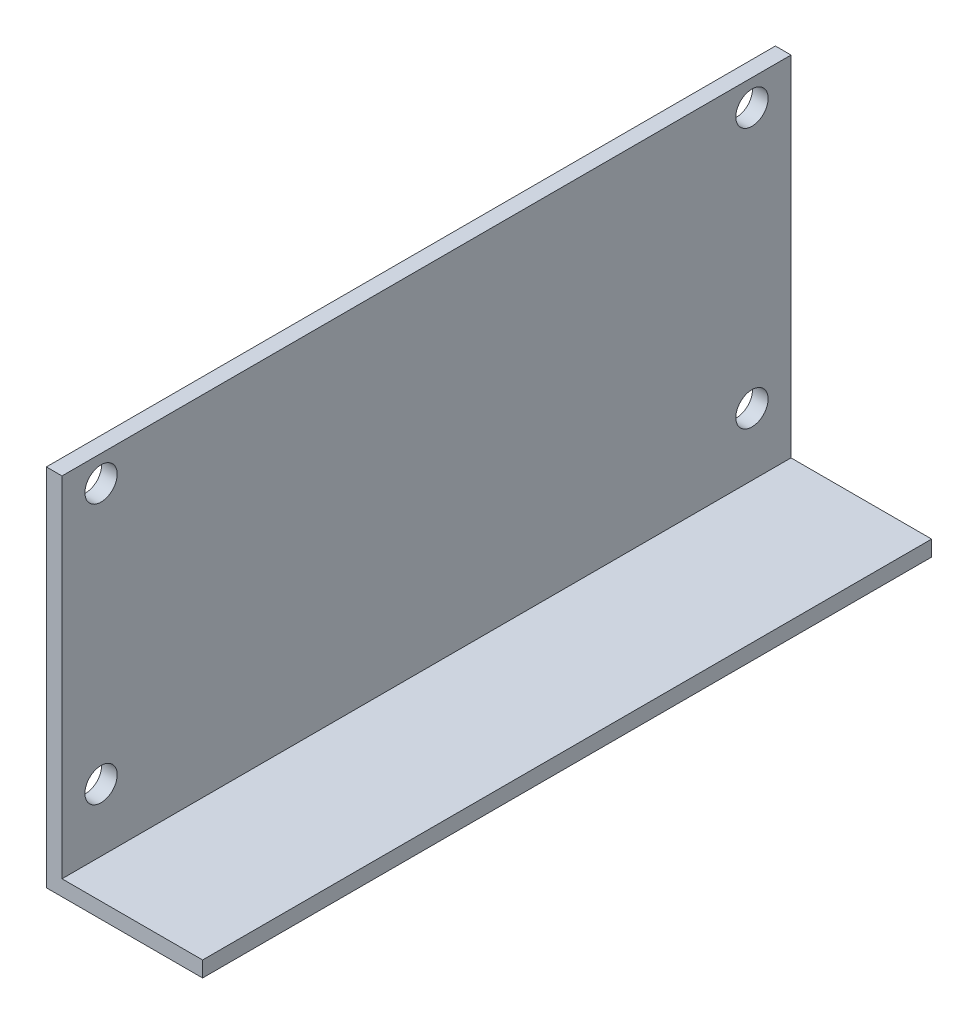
ISO-10303-21;
HEADER;
FILE_DESCRIPTION(('STEP AP214'),'2;1');
FILE_NAME('part.step','',(''),(''),'','','');
FILE_SCHEMA(('AUTOMOTIVE_DESIGN { 1 0 10303 214 1 1 1 1 }'));
ENDSEC;
DATA;
#1=APPLICATION_CONTEXT('core data for automotive mechanical design processes');
#2=APPLICATION_PROTOCOL_DEFINITION('international standard','automotive_design',2000,#1);
#3=PRODUCT_CONTEXT('',#1,'mechanical');
#4=PRODUCT('Part','Part','',(#3));
#5=PRODUCT_RELATED_PRODUCT_CATEGORY('part','',(#4));
#6=PRODUCT_DEFINITION_FORMATION('','',#4);
#7=PRODUCT_DEFINITION_CONTEXT('part definition',#1,'design');
#8=PRODUCT_DEFINITION('design','',#6,#7);
#9=PRODUCT_DEFINITION_SHAPE('','',#8);
#10=(LENGTH_UNIT() NAMED_UNIT(*) SI_UNIT(.MILLI.,.METRE.));
#11=(NAMED_UNIT(*) PLANE_ANGLE_UNIT() SI_UNIT($,.RADIAN.));
#12=(NAMED_UNIT(*) SI_UNIT($,.STERADIAN.) SOLID_ANGLE_UNIT());
#13=UNCERTAINTY_MEASURE_WITH_UNIT(LENGTH_MEASURE(1.E-05),#10,'distance_accuracy_value','');
#14=(GEOMETRIC_REPRESENTATION_CONTEXT(3) GLOBAL_UNCERTAINTY_ASSIGNED_CONTEXT((#13)) GLOBAL_UNIT_ASSIGNED_CONTEXT((#10,
#11,#12)) REPRESENTATION_CONTEXT('',''));
#15=CARTESIAN_POINT('',(0.,0.,0.));
#16=DIRECTION('',(0.,0.,1.));
#17=DIRECTION('',(1.,0.,0.));
#18=AXIS2_PLACEMENT_3D('',#15,#16,#17);
#19=CARTESIAN_POINT('',(0.,0.,70.));
#20=DIRECTION('',(1.,0.,0.));
#21=DIRECTION('',(0.,0.,-1.));
#22=AXIS2_PLACEMENT_3D('',#19,#20,#21);
#23=PLANE('',#22);
#24=CARTESIAN_POINT('',(-1.11022302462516E-13,14.9999999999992,-62.5));
#25=DIRECTION('',(1.,0.,0.));
#26=DIRECTION('',(0.,1.,0.));
#27=AXIS2_PLACEMENT_3D('',#24,#25,#26);
#28=CIRCLE('',#27,3.1);
#29=CARTESIAN_POINT('',(-1.11650492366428E-13,18.0999999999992,-62.5));
#30=VERTEX_POINT('',#29);
#31=EDGE_CURVE('E481',#30,#30,#28,.T.);
#32=ORIENTED_EDGE('',*,*,#31,.T.);
#33=EDGE_LOOP('',(#32));
#34=FACE_BOUND('',#33,.T.);
#35=CARTESIAN_POINT('',(-1.11022302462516E-13,64.9999999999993,-62.5));
#36=DIRECTION('',(1.,0.,0.));
#37=DIRECTION('',(0.,1.,0.));
#38=AXIS2_PLACEMENT_3D('',#35,#36,#37);
#39=CIRCLE('',#38,3.1);
#40=CARTESIAN_POINT('',(-1.11650492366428E-13,68.0999999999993,-62.5));
#41=VERTEX_POINT('',#40);
#42=EDGE_CURVE('E485',#41,#41,#39,.T.);
#43=ORIENTED_EDGE('',*,*,#42,.T.);
#44=EDGE_LOOP('',(#43));
#45=FACE_BOUND('',#44,.T.);
#46=CARTESIAN_POINT('',(0.,14.9999999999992,62.5));
#47=DIRECTION('',(1.,0.,0.));
#48=DIRECTION('',(0.,1.,0.));
#49=AXIS2_PLACEMENT_3D('',#46,#47,#48);
#50=CIRCLE('',#49,3.1);
#51=CARTESIAN_POINT('',(0.,18.0999999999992,62.5));
#52=VERTEX_POINT('',#51);
#53=EDGE_CURVE('E489',#52,#52,#50,.T.);
#54=ORIENTED_EDGE('',*,*,#53,.T.);
#55=EDGE_LOOP('',(#54));
#56=FACE_BOUND('',#55,.T.);
#57=CARTESIAN_POINT('',(0.,64.9999999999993,62.5));
#58=DIRECTION('',(1.,0.,0.));
#59=DIRECTION('',(0.,1.,0.));
#60=AXIS2_PLACEMENT_3D('',#57,#58,#59);
#61=CIRCLE('',#60,3.1);
#62=CARTESIAN_POINT('',(0.,68.0999999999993,62.5));
#63=VERTEX_POINT('',#62);
#64=EDGE_CURVE('E418',#63,#63,#61,.T.);
#65=ORIENTED_EDGE('',*,*,#64,.T.);
#66=EDGE_LOOP('',(#65));
#67=FACE_BOUND('',#66,.T.);
#68=DIRECTION('',(0.,-1.,0.));
#69=VECTOR('',#68,1.);
#70=CARTESIAN_POINT('',(-1.11022302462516E-13,0.,-70.));
#71=LINE('',#70,#69);
#72=CARTESIAN_POINT('',(-1.11022302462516E-13,70.0000000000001,-70.));
#73=VERTEX_POINT('',#72);
#74=CARTESIAN_POINT('',(-1.11022302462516E-13,0.,-70.));
#75=VERTEX_POINT('',#74);
#76=EDGE_CURVE('E404',#73,#75,#71,.T.);
#77=ORIENTED_EDGE('',*,*,#76,.T.);
#78=DIRECTION('',(0.,0.,-1.));
#79=VECTOR('',#78,1.);
#80=CARTESIAN_POINT('',(0.,0.,70.));
#81=LINE('',#80,#79);
#82=CARTESIAN_POINT('',(0.,0.,70.));
#83=VERTEX_POINT('',#82);
#84=EDGE_CURVE('E11',#83,#75,#81,.T.);
#85=ORIENTED_EDGE('',*,*,#84,.F.);
#86=DIRECTION('',(0.,-1.,0.));
#87=VECTOR('',#86,1.);
#88=CARTESIAN_POINT('',(0.,0.,70.));
#89=LINE('',#88,#87);
#90=CARTESIAN_POINT('',(0.,70.0000000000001,70.));
#91=VERTEX_POINT('',#90);
#92=EDGE_CURVE('E432',#91,#83,#89,.T.);
#93=ORIENTED_EDGE('',*,*,#92,.F.);
#94=DIRECTION('',(0.,0.,-1.));
#95=VECTOR('',#94,1.);
#96=CARTESIAN_POINT('',(0.,70.0000000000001,70.));
#97=LINE('',#96,#95);
#98=EDGE_CURVE('E417',#91,#73,#97,.T.);
#99=ORIENTED_EDGE('',*,*,#98,.T.);
#100=EDGE_LOOP('',(#77,#85,#93,#99));
#101=FACE_BOUND('',#100,.T.);
#102=ADVANCED_FACE('F348',(#34,#45,#56,#67,#101),#23,.F.);
#103=CARTESIAN_POINT('',(0.,0.,70.));
#104=DIRECTION('',(0.,1.,0.));
#105=DIRECTION('',(0.,0.,1.));
#106=AXIS2_PLACEMENT_3D('',#103,#104,#105);
#107=PLANE('',#106);
#108=DIRECTION('',(1.,0.,0.));
#109=VECTOR('',#108,1.);
#110=CARTESIAN_POINT('',(-1.11022302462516E-13,0.,-70.));
#111=LINE('',#110,#109);
#112=CARTESIAN_POINT('',(29.9999999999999,0.,-70.));
#113=VERTEX_POINT('',#112);
#114=EDGE_CURVE('E400',#75,#113,#111,.T.);
#115=ORIENTED_EDGE('',*,*,#114,.T.);
#116=DIRECTION('',(0.,0.,-1.));
#117=VECTOR('',#116,1.);
#118=CARTESIAN_POINT('',(29.9999999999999,0.,70.));
#119=LINE('',#118,#117);
#120=CARTESIAN_POINT('',(29.9999999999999,0.,70.));
#121=VERTEX_POINT('',#120);
#122=EDGE_CURVE('E355',#121,#113,#119,.T.);
#123=ORIENTED_EDGE('',*,*,#122,.F.);
#124=DIRECTION('',(1.,0.,0.));
#125=VECTOR('',#124,1.);
#126=CARTESIAN_POINT('',(0.,0.,70.));
#127=LINE('',#126,#125);
#128=EDGE_CURVE('E413',#83,#121,#127,.T.);
#129=ORIENTED_EDGE('',*,*,#128,.F.);
#130=ORIENTED_EDGE('',*,*,#84,.T.);
#131=EDGE_LOOP('',(#115,#123,#129,#130));
#132=FACE_BOUND('',#131,.T.);
#133=ADVANCED_FACE('F412',(#132),#107,.F.);
#134=CARTESIAN_POINT('',(29.9999999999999,0.,70.));
#135=DIRECTION('',(-1.,0.,0.));
#136=DIRECTION('',(0.,0.,1.));
#137=AXIS2_PLACEMENT_3D('',#134,#135,#136);
#138=PLANE('',#137);
#139=DIRECTION('',(0.,1.,0.));
#140=VECTOR('',#139,1.);
#141=CARTESIAN_POINT('',(29.9999999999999,0.,-70.));
#142=LINE('',#141,#140);
#143=CARTESIAN_POINT('',(29.9999999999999,3.00000000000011,-70.));
#144=VERTEX_POINT('',#143);
#145=EDGE_CURVE('E406',#113,#144,#142,.T.);
#146=ORIENTED_EDGE('',*,*,#145,.T.);
#147=DIRECTION('',(0.,0.,-1.));
#148=VECTOR('',#147,1.);
#149=CARTESIAN_POINT('',(29.9999999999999,2.99999999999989,70.));
#150=LINE('',#149,#148);
#151=CARTESIAN_POINT('',(29.9999999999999,2.99999999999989,70.));
#152=VERTEX_POINT('',#151);
#153=EDGE_CURVE('E448',#152,#144,#150,.T.);
#154=ORIENTED_EDGE('',*,*,#153,.F.);
#155=DIRECTION('',(0.,1.,0.));
#156=VECTOR('',#155,1.);
#157=CARTESIAN_POINT('',(29.9999999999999,0.,70.));
#158=LINE('',#157,#156);
#159=EDGE_CURVE('E435',#121,#152,#158,.T.);
#160=ORIENTED_EDGE('',*,*,#159,.F.);
#161=ORIENTED_EDGE('',*,*,#122,.T.);
#162=EDGE_LOOP('',(#146,#154,#160,#161));
#163=FACE_BOUND('',#162,.T.);
#164=ADVANCED_FACE('F452',(#163),#138,.F.);
#165=CARTESIAN_POINT('',(3.,2.99999999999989,70.));
#166=DIRECTION('',(0.,-1.,0.));
#167=DIRECTION('',(1.,0.,0.));
#168=AXIS2_PLACEMENT_3D('',#165,#166,#167);
#169=PLANE('',#168);
#170=DIRECTION('',(-1.,0.,0.));
#171=VECTOR('',#170,1.);
#172=CARTESIAN_POINT('',(3.,3.00000000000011,-70.));
#173=LINE('',#172,#171);
#174=CARTESIAN_POINT('',(3.,3.00000000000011,-70.));
#175=VERTEX_POINT('',#174);
#176=EDGE_CURVE('E426',#144,#175,#173,.T.);
#177=ORIENTED_EDGE('',*,*,#176,.T.);
#178=DIRECTION('',(0.,0.,-1.));
#179=VECTOR('',#178,1.);
#180=CARTESIAN_POINT('',(3.,2.99999999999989,70.));
#181=LINE('',#180,#179);
#182=CARTESIAN_POINT('',(3.,2.99999999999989,70.));
#183=VERTEX_POINT('',#182);
#184=EDGE_CURVE('E445',#183,#175,#181,.T.);
#185=ORIENTED_EDGE('',*,*,#184,.F.);
#186=DIRECTION('',(-1.,0.,0.));
#187=VECTOR('',#186,1.);
#188=CARTESIAN_POINT('',(3.,2.99999999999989,70.));
#189=LINE('',#188,#187);
#190=EDGE_CURVE('E437',#152,#183,#189,.T.);
#191=ORIENTED_EDGE('',*,*,#190,.F.);
#192=ORIENTED_EDGE('',*,*,#153,.T.);
#193=EDGE_LOOP('',(#177,#185,#191,#192));
#194=FACE_BOUND('',#193,.T.);
#195=ADVANCED_FACE('F458',(#194),#169,.F.);
#196=CARTESIAN_POINT('',(3.,70.0000000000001,70.));
#197=DIRECTION('',(-1.,0.,0.));
#198=DIRECTION('',(0.,-1.,0.));
#199=AXIS2_PLACEMENT_3D('',#196,#197,#198);
#200=PLANE('',#199);
#201=CARTESIAN_POINT('',(2.99999999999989,14.9999999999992,-62.5));
#202=DIRECTION('',(1.,0.,0.));
#203=DIRECTION('',(0.,1.,0.));
#204=AXIS2_PLACEMENT_3D('',#201,#202,#203);
#205=CIRCLE('',#204,3.1);
#206=CARTESIAN_POINT('',(2.99999999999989,18.0999999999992,-62.5));
#207=VERTEX_POINT('',#206);
#208=EDGE_CURVE('E510',#207,#207,#205,.T.);
#209=ORIENTED_EDGE('',*,*,#208,.F.);
#210=EDGE_LOOP('',(#209));
#211=FACE_BOUND('',#210,.T.);
#212=CARTESIAN_POINT('',(2.99999999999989,64.9999999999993,-62.5));
#213=DIRECTION('',(1.,0.,0.));
#214=DIRECTION('',(0.,1.,0.));
#215=AXIS2_PLACEMENT_3D('',#212,#213,#214);
#216=CIRCLE('',#215,3.1);
#217=CARTESIAN_POINT('',(2.99999999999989,68.0999999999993,-62.5));
#218=VERTEX_POINT('',#217);
#219=EDGE_CURVE('E506',#218,#218,#216,.T.);
#220=ORIENTED_EDGE('',*,*,#219,.F.);
#221=EDGE_LOOP('',(#220));
#222=FACE_BOUND('',#221,.T.);
#223=CARTESIAN_POINT('',(3.,14.9999999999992,62.5));
#224=DIRECTION('',(1.,0.,0.));
#225=DIRECTION('',(0.,1.,0.));
#226=AXIS2_PLACEMENT_3D('',#223,#224,#225);
#227=CIRCLE('',#226,3.1);
#228=CARTESIAN_POINT('',(3.,18.0999999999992,62.5));
#229=VERTEX_POINT('',#228);
#230=EDGE_CURVE('E500',#229,#229,#227,.T.);
#231=ORIENTED_EDGE('',*,*,#230,.F.);
#232=EDGE_LOOP('',(#231));
#233=FACE_BOUND('',#232,.T.);
#234=CARTESIAN_POINT('',(3.,64.9999999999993,62.5));
#235=DIRECTION('',(1.,0.,0.));
#236=DIRECTION('',(0.,1.,0.));
#237=AXIS2_PLACEMENT_3D('',#234,#235,#236);
#238=CIRCLE('',#237,3.1);
#239=CARTESIAN_POINT('',(3.,68.0999999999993,62.5));
#240=VERTEX_POINT('',#239);
#241=EDGE_CURVE('E421',#240,#240,#238,.T.);
#242=ORIENTED_EDGE('',*,*,#241,.F.);
#243=EDGE_LOOP('',(#242));
#244=FACE_BOUND('',#243,.T.);
#245=DIRECTION('',(0.,1.,0.));
#246=VECTOR('',#245,1.);
#247=CARTESIAN_POINT('',(2.99999999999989,70.0000000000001,-70.));
#248=LINE('',#247,#246);
#249=CARTESIAN_POINT('',(2.99999999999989,70.0000000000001,-70.));
#250=VERTEX_POINT('',#249);
#251=EDGE_CURVE('E428',#175,#250,#248,.T.);
#252=ORIENTED_EDGE('',*,*,#251,.T.);
#253=DIRECTION('',(0.,0.,-1.));
#254=VECTOR('',#253,1.);
#255=CARTESIAN_POINT('',(3.,70.0000000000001,70.));
#256=LINE('',#255,#254);
#257=CARTESIAN_POINT('',(3.,70.0000000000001,70.));
#258=VERTEX_POINT('',#257);
#259=EDGE_CURVE('E442',#258,#250,#256,.T.);
#260=ORIENTED_EDGE('',*,*,#259,.F.);
#261=DIRECTION('',(0.,1.,0.));
#262=VECTOR('',#261,1.);
#263=CARTESIAN_POINT('',(3.,70.0000000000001,70.));
#264=LINE('',#263,#262);
#265=EDGE_CURVE('E367',#183,#258,#264,.T.);
#266=ORIENTED_EDGE('',*,*,#265,.F.);
#267=ORIENTED_EDGE('',*,*,#184,.T.);
#268=EDGE_LOOP('',(#252,#260,#266,#267));
#269=FACE_BOUND('',#268,.T.);
#270=ADVANCED_FACE('F461',(#211,#222,#233,#244,#269),#200,.F.);
#271=CARTESIAN_POINT('',(0.,70.0000000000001,70.));
#272=DIRECTION('',(0.,-1.,0.));
#273=DIRECTION('',(0.,0.,-1.));
#274=AXIS2_PLACEMENT_3D('',#271,#272,#273);
#275=PLANE('',#274);
#276=DIRECTION('',(-1.,0.,0.));
#277=VECTOR('',#276,1.);
#278=CARTESIAN_POINT('',(-1.11022302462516E-13,70.0000000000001,-70.));
#279=LINE('',#278,#277);
#280=EDGE_CURVE('E430',#250,#73,#279,.T.);
#281=ORIENTED_EDGE('',*,*,#280,.T.);
#282=ORIENTED_EDGE('',*,*,#98,.F.);
#283=DIRECTION('',(-1.,0.,0.));
#284=VECTOR('',#283,1.);
#285=CARTESIAN_POINT('',(0.,70.0000000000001,70.));
#286=LINE('',#285,#284);
#287=EDGE_CURVE('E362',#258,#91,#286,.T.);
#288=ORIENTED_EDGE('',*,*,#287,.F.);
#289=ORIENTED_EDGE('',*,*,#259,.T.);
#290=EDGE_LOOP('',(#281,#282,#288,#289));
#291=FACE_BOUND('',#290,.T.);
#292=ADVANCED_FACE('F463',(#291),#275,.F.);
#293=CARTESIAN_POINT('',(0.,70.0000000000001,70.));
#294=DIRECTION('',(0.,0.,-1.));
#295=DIRECTION('',(-1.,0.,0.));
#296=AXIS2_PLACEMENT_3D('',#293,#294,#295);
#297=PLANE('',#296);
#298=ORIENTED_EDGE('',*,*,#92,.T.);
#299=ORIENTED_EDGE('',*,*,#128,.T.);
#300=ORIENTED_EDGE('',*,*,#159,.T.);
#301=ORIENTED_EDGE('',*,*,#190,.T.);
#302=ORIENTED_EDGE('',*,*,#265,.T.);
#303=ORIENTED_EDGE('',*,*,#287,.T.);
#304=EDGE_LOOP('',(#298,#299,#300,#301,#302,#303));
#305=FACE_BOUND('',#304,.T.);
#306=ADVANCED_FACE('F455',(#305),#297,.F.);
#307=CARTESIAN_POINT('',(-1.11022302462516E-13,70.0000000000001,-70.));
#308=DIRECTION('',(0.,0.,-1.));
#309=DIRECTION('',(-1.,0.,0.));
#310=AXIS2_PLACEMENT_3D('',#307,#308,#309);
#311=PLANE('',#310);
#312=ORIENTED_EDGE('',*,*,#76,.F.);
#313=ORIENTED_EDGE('',*,*,#280,.F.);
#314=ORIENTED_EDGE('',*,*,#251,.F.);
#315=ORIENTED_EDGE('',*,*,#176,.F.);
#316=ORIENTED_EDGE('',*,*,#145,.F.);
#317=ORIENTED_EDGE('',*,*,#114,.F.);
#318=EDGE_LOOP('',(#312,#313,#314,#315,#316,#317));
#319=FACE_BOUND('',#318,.T.);
#320=ADVANCED_FACE('F401',(#319),#311,.T.);
#321=CARTESIAN_POINT('',(0.,64.9999999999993,62.5));
#322=DIRECTION('',(1.,0.,0.));
#323=DIRECTION('',(0.,1.,0.));
#324=AXIS2_PLACEMENT_3D('',#321,#322,#323);
#325=CYLINDRICAL_SURFACE('',#324,3.1);
#326=ORIENTED_EDGE('',*,*,#64,.F.);
#327=EDGE_LOOP('',(#326));
#328=FACE_BOUND('',#327,.T.);
#329=ORIENTED_EDGE('',*,*,#241,.T.);
#330=EDGE_LOOP('',(#329));
#331=FACE_BOUND('',#330,.T.);
#332=ADVANCED_FACE('F492',(#328,#331),#325,.F.);
#333=CARTESIAN_POINT('',(0.,14.9999999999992,62.5));
#334=DIRECTION('',(1.,0.,0.));
#335=DIRECTION('',(0.,1.,0.));
#336=AXIS2_PLACEMENT_3D('',#333,#334,#335);
#337=CYLINDRICAL_SURFACE('',#336,3.1);
#338=ORIENTED_EDGE('',*,*,#53,.F.);
#339=EDGE_LOOP('',(#338));
#340=FACE_BOUND('',#339,.T.);
#341=ORIENTED_EDGE('',*,*,#230,.T.);
#342=EDGE_LOOP('',(#341));
#343=FACE_BOUND('',#342,.T.);
#344=ADVANCED_FACE('F495',(#340,#343),#337,.F.);
#345=CARTESIAN_POINT('',(-1.11022302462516E-13,64.9999999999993,-62.5));
#346=DIRECTION('',(1.,0.,0.));
#347=DIRECTION('',(0.,1.,0.));
#348=AXIS2_PLACEMENT_3D('',#345,#346,#347);
#349=CYLINDRICAL_SURFACE('',#348,3.1);
#350=ORIENTED_EDGE('',*,*,#42,.F.);
#351=EDGE_LOOP('',(#350));
#352=FACE_BOUND('',#351,.T.);
#353=ORIENTED_EDGE('',*,*,#219,.T.);
#354=EDGE_LOOP('',(#353));
#355=FACE_BOUND('',#354,.T.);
#356=ADVANCED_FACE('F521',(#352,#355),#349,.F.);
#357=CARTESIAN_POINT('',(-1.11022302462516E-13,14.9999999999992,-62.5));
#358=DIRECTION('',(1.,0.,0.));
#359=DIRECTION('',(0.,1.,0.));
#360=AXIS2_PLACEMENT_3D('',#357,#358,#359);
#361=CYLINDRICAL_SURFACE('',#360,3.1);
#362=ORIENTED_EDGE('',*,*,#31,.F.);
#363=EDGE_LOOP('',(#362));
#364=FACE_BOUND('',#363,.T.);
#365=ORIENTED_EDGE('',*,*,#208,.T.);
#366=EDGE_LOOP('',(#365));
#367=FACE_BOUND('',#366,.T.);
#368=ADVANCED_FACE('F514',(#364,#367),#361,.F.);
#369=CLOSED_SHELL('',(#102,#133,#164,#195,#270,#292,#306,#320,#332,#344,#356,#368));
#370=MANIFOLD_SOLID_BREP('B2',#369);
#371=ADVANCED_BREP_SHAPE_REPRESENTATION('',(#18,#370),#14);
#372=SHAPE_DEFINITION_REPRESENTATION(#9,#371);
ENDSEC;
END-ISO-10303-21;
